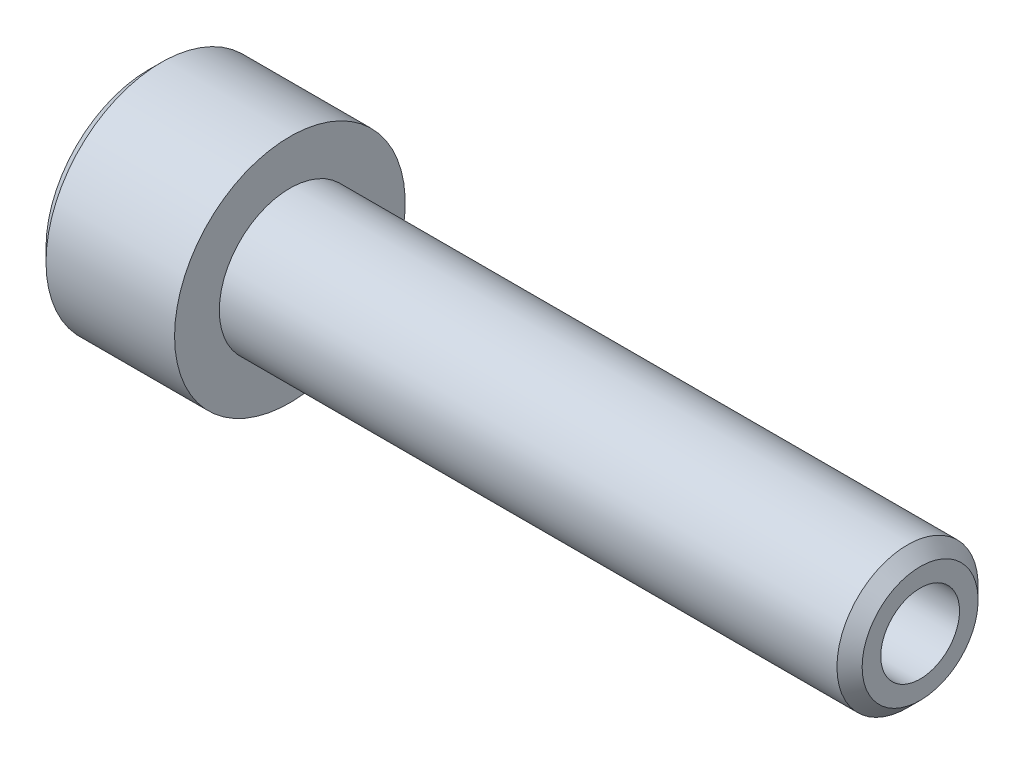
ISO-10303-21;
HEADER;
FILE_DESCRIPTION(('STEP AP214'),'2;1');
FILE_NAME('part.step','',(''),(''),'','','');
FILE_SCHEMA(('AUTOMOTIVE_DESIGN { 1 0 10303 214 1 1 1 1 }'));
ENDSEC;
DATA;
#1=APPLICATION_CONTEXT('core data for automotive mechanical design processes');
#2=APPLICATION_PROTOCOL_DEFINITION('international standard','automotive_design',2000,#1);
#3=PRODUCT_CONTEXT('',#1,'mechanical');
#4=PRODUCT('Part','Part','',(#3));
#5=PRODUCT_RELATED_PRODUCT_CATEGORY('part','',(#4));
#6=PRODUCT_DEFINITION_FORMATION('','',#4);
#7=PRODUCT_DEFINITION_CONTEXT('part definition',#1,'design');
#8=PRODUCT_DEFINITION('design','',#6,#7);
#9=PRODUCT_DEFINITION_SHAPE('','',#8);
#10=(LENGTH_UNIT() NAMED_UNIT(*) SI_UNIT(.MILLI.,.METRE.));
#11=(NAMED_UNIT(*) PLANE_ANGLE_UNIT() SI_UNIT($,.RADIAN.));
#12=(NAMED_UNIT(*) SI_UNIT($,.STERADIAN.) SOLID_ANGLE_UNIT());
#13=UNCERTAINTY_MEASURE_WITH_UNIT(LENGTH_MEASURE(1.E-05),#10,'distance_accuracy_value','');
#14=(GEOMETRIC_REPRESENTATION_CONTEXT(3) GLOBAL_UNCERTAINTY_ASSIGNED_CONTEXT((#13)) GLOBAL_UNIT_ASSIGNED_CONTEXT((#10,
#11,#12)) REPRESENTATION_CONTEXT('',''));
#15=CARTESIAN_POINT('',(0.,0.,0.));
#16=DIRECTION('',(0.,0.,1.));
#17=DIRECTION('',(1.,0.,0.));
#18=AXIS2_PLACEMENT_3D('',#15,#16,#17);
#19=CARTESIAN_POINT('',(0.,1.42239999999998,0.));
#20=DIRECTION('',(-1.,0.,0.));
#21=DIRECTION('',(0.,0.,1.));
#22=AXIS2_PLACEMENT_3D('',#19,#20,#21);
#23=PLANE('',#22);
#24=CARTESIAN_POINT('',(0.,0.,0.));
#25=DIRECTION('',(-1.,0.,0.));
#26=DIRECTION('',(0.,0.,1.));
#27=AXIS2_PLACEMENT_3D('',#24,#25,#26);
#28=CIRCLE('',#27,2.3241);
#29=CARTESIAN_POINT('',(0.,0.,2.32409999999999));
#30=VERTEX_POINT('',#29);
#31=EDGE_CURVE('E144',#30,#30,#28,.T.);
#32=ORIENTED_EDGE('',*,*,#31,.F.);
#33=EDGE_LOOP('',(#32));
#34=FACE_BOUND('',#33,.T.);
#35=CARTESIAN_POINT('',(0.,0.,0.));
#36=DIRECTION('',(-1.,0.,0.));
#37=DIRECTION('',(0.,0.,1.));
#38=AXIS2_PLACEMENT_3D('',#35,#36,#37);
#39=CIRCLE('',#38,1.42239999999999);
#40=CARTESIAN_POINT('',(0.,0.,1.42239999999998));
#41=VERTEX_POINT('',#40);
#42=EDGE_CURVE('E11',#41,#41,#39,.T.);
#43=ORIENTED_EDGE('',*,*,#42,.T.);
#44=EDGE_LOOP('',(#43));
#45=FACE_BOUND('',#44,.T.);
#46=ADVANCED_FACE('F40',(#34,#45),#23,.F.);
#47=CARTESIAN_POINT('',(-52.8448,0.,0.));
#48=DIRECTION('',(-1.,0.,0.));
#49=DIRECTION('',(0.,0.,1.));
#50=AXIS2_PLACEMENT_3D('',#47,#48,#49);
#51=CYLINDRICAL_SURFACE('',#50,1.4224);
#52=CARTESIAN_POINT('',(12.446,0.,0.));
#53=DIRECTION('',(-1.,0.,0.));
#54=DIRECTION('',(0.,0.,1.));
#55=AXIS2_PLACEMENT_3D('',#52,#53,#54);
#56=CIRCLE('',#55,1.4224);
#57=CARTESIAN_POINT('',(12.446,0.,1.42239999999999));
#58=VERTEX_POINT('',#57);
#59=EDGE_CURVE('E48',#58,#58,#56,.T.);
#60=ORIENTED_EDGE('',*,*,#59,.T.);
#61=EDGE_LOOP('',(#60));
#62=FACE_BOUND('',#61,.T.);
#63=ORIENTED_EDGE('',*,*,#42,.F.);
#64=EDGE_LOOP('',(#63));
#65=FACE_BOUND('',#64,.T.);
#66=ADVANCED_FACE('F164',(#62,#65),#51,.T.);
#67=CARTESIAN_POINT('',(12.446,0.,0.));
#68=DIRECTION('',(-1.,0.,0.));
#69=DIRECTION('',(0.,0.,1.));
#70=AXIS2_PLACEMENT_3D('',#67,#68,#69);
#71=CONICAL_SURFACE('',#70,1.4224,0.785398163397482);
#72=CARTESIAN_POINT('',(12.7,0.,0.));
#73=DIRECTION('',(-1.,0.,0.));
#74=DIRECTION('',(0.,0.,1.));
#75=AXIS2_PLACEMENT_3D('',#72,#73,#74);
#76=CIRCLE('',#75,1.16839999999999);
#77=CARTESIAN_POINT('',(12.7,0.,1.16839999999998));
#78=VERTEX_POINT('',#77);
#79=EDGE_CURVE('E158',#78,#78,#76,.T.);
#80=ORIENTED_EDGE('',*,*,#79,.T.);
#81=EDGE_LOOP('',(#80));
#82=FACE_BOUND('',#81,.T.);
#83=ORIENTED_EDGE('',*,*,#59,.F.);
#84=EDGE_LOOP('',(#83));
#85=FACE_BOUND('',#84,.T.);
#86=ADVANCED_FACE('F167',(#82,#85),#71,.T.);
#87=CARTESIAN_POINT('',(12.7,1.16839999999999,0.));
#88=DIRECTION('',(1.,0.,0.));
#89=DIRECTION('',(0.,0.,-1.));
#90=AXIS2_PLACEMENT_3D('',#87,#88,#89);
#91=PLANE('',#90);
#92=CARTESIAN_POINT('',(12.7,0.,0.));
#93=DIRECTION('',(1.,0.,0.));
#94=DIRECTION('',(0.,0.,-1.));
#95=AXIS2_PLACEMENT_3D('',#92,#93,#94);
#96=CIRCLE('',#95,0.793749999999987);
#97=CARTESIAN_POINT('',(12.7,0.,-0.793749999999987));
#98=VERTEX_POINT('',#97);
#99=EDGE_CURVE('E216',#98,#98,#96,.T.);
#100=ORIENTED_EDGE('',*,*,#99,.F.);
#101=EDGE_LOOP('',(#100));
#102=FACE_BOUND('',#101,.T.);
#103=ORIENTED_EDGE('',*,*,#79,.F.);
#104=EDGE_LOOP('',(#103));
#105=FACE_BOUND('',#104,.T.);
#106=ADVANCED_FACE('F169',(#102,#105),#91,.T.);
#107=CARTESIAN_POINT('',(-2.84479999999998,2.07009999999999,0.));
#108=DIRECTION('',(1.,0.,0.));
#109=DIRECTION('',(0.,0.,-1.));
#110=AXIS2_PLACEMENT_3D('',#107,#108,#109);
#111=PLANE('',#110);
#112=DIRECTION('',(0.,0.866025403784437,-0.500000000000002));
#113=VECTOR('',#112,1.);
#114=CARTESIAN_POINT('',(-2.84479999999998,-1.190625,-0.68740766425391));
#115=LINE('',#114,#113);
#116=CARTESIAN_POINT('',(-2.84479999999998,-1.190625,-0.68740766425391));
#117=VERTEX_POINT('',#116);
#118=CARTESIAN_POINT('',(-2.84479999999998,0.,-1.3748153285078));
#119=VERTEX_POINT('',#118);
#120=EDGE_CURVE('E130',#117,#119,#115,.T.);
#121=ORIENTED_EDGE('',*,*,#120,.T.);
#122=DIRECTION('',(0.,-0.866025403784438,-0.500000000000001));
#123=VECTOR('',#122,1.);
#124=CARTESIAN_POINT('',(-2.84479999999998,1.19062499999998,-0.687407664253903));
#125=LINE('',#124,#123);
#126=CARTESIAN_POINT('',(-2.84479999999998,1.19062499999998,-0.687407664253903));
#127=VERTEX_POINT('',#126);
#128=EDGE_CURVE('E55',#127,#119,#125,.T.);
#129=ORIENTED_EDGE('',*,*,#128,.F.);
#130=DIRECTION('',(0.,0.,1.));
#131=VECTOR('',#130,1.);
#132=CARTESIAN_POINT('',(-2.84479999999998,1.19062499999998,-0.687407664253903));
#133=LINE('',#132,#131);
#134=CARTESIAN_POINT('',(-2.84479999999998,1.190625,0.687407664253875));
#135=VERTEX_POINT('',#134);
#136=EDGE_CURVE('E139',#127,#135,#133,.T.);
#137=ORIENTED_EDGE('',*,*,#136,.T.);
#138=DIRECTION('',(0.,-0.866025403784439,0.499999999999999));
#139=VECTOR('',#138,1.);
#140=CARTESIAN_POINT('',(-2.84479999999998,1.190625,0.687407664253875));
#141=LINE('',#140,#139);
#142=CARTESIAN_POINT('',(-2.84479999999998,0.,1.37481532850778));
#143=VERTEX_POINT('',#142);
#144=EDGE_CURVE('E137',#135,#143,#141,.T.);
#145=ORIENTED_EDGE('',*,*,#144,.T.);
#146=DIRECTION('',(0.,0.866025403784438,0.500000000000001));
#147=VECTOR('',#146,1.);
#148=CARTESIAN_POINT('',(-2.84479999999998,-1.19062499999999,0.687407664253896));
#149=LINE('',#148,#147);
#150=CARTESIAN_POINT('',(-2.84479999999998,-1.19062499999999,0.687407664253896));
#151=VERTEX_POINT('',#150);
#152=EDGE_CURVE('E115',#151,#143,#149,.T.);
#153=ORIENTED_EDGE('',*,*,#152,.F.);
#154=DIRECTION('',(0.,0.,1.));
#155=VECTOR('',#154,1.);
#156=CARTESIAN_POINT('',(-2.84479999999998,-1.190625,-0.68740766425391));
#157=LINE('',#156,#155);
#158=EDGE_CURVE('E133',#117,#151,#157,.T.);
#159=ORIENTED_EDGE('',*,*,#158,.F.);
#160=EDGE_LOOP('',(#121,#129,#137,#145,#153,#159));
#161=FACE_BOUND('',#160,.T.);
#162=CARTESIAN_POINT('',(-2.84479999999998,0.,0.));
#163=DIRECTION('',(-1.,0.,0.));
#164=DIRECTION('',(0.,0.,1.));
#165=AXIS2_PLACEMENT_3D('',#162,#163,#164);
#166=CIRCLE('',#165,2.0701);
#167=CARTESIAN_POINT('',(-2.84479999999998,0.,2.07009999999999));
#168=VERTEX_POINT('',#167);
#169=EDGE_CURVE('E155',#168,#168,#166,.T.);
#170=ORIENTED_EDGE('',*,*,#169,.T.);
#171=EDGE_LOOP('',(#170));
#172=FACE_BOUND('',#171,.T.);
#173=ADVANCED_FACE('F176',(#161,#172),#111,.F.);
#174=CARTESIAN_POINT('',(-2.5908,0.,0.));
#175=DIRECTION('',(1.,0.,0.));
#176=DIRECTION('',(0.,0.,-1.));
#177=AXIS2_PLACEMENT_3D('',#174,#175,#176);
#178=CONICAL_SURFACE('',#177,2.3241,0.78539816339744);
#179=ORIENTED_EDGE('',*,*,#169,.F.);
#180=EDGE_LOOP('',(#179));
#181=FACE_BOUND('',#180,.T.);
#182=CARTESIAN_POINT('',(-2.5908,0.,0.));
#183=DIRECTION('',(-1.,0.,0.));
#184=DIRECTION('',(0.,0.,1.));
#185=AXIS2_PLACEMENT_3D('',#182,#183,#184);
#186=CIRCLE('',#185,2.3241);
#187=CARTESIAN_POINT('',(-2.5908,0.,2.32409999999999));
#188=VERTEX_POINT('',#187);
#189=EDGE_CURVE('E152',#188,#188,#186,.T.);
#190=ORIENTED_EDGE('',*,*,#189,.T.);
#191=EDGE_LOOP('',(#190));
#192=FACE_BOUND('',#191,.T.);
#193=ADVANCED_FACE('F190',(#181,#192),#178,.T.);
#194=CARTESIAN_POINT('',(-52.8448,0.,0.));
#195=DIRECTION('',(-1.,0.,0.));
#196=DIRECTION('',(0.,0.,1.));
#197=AXIS2_PLACEMENT_3D('',#194,#195,#196);
#198=CYLINDRICAL_SURFACE('',#197,2.3241);
#199=ORIENTED_EDGE('',*,*,#189,.F.);
#200=EDGE_LOOP('',(#199));
#201=FACE_BOUND('',#200,.T.);
#202=ORIENTED_EDGE('',*,*,#31,.T.);
#203=EDGE_LOOP('',(#202));
#204=FACE_BOUND('',#203,.T.);
#205=ADVANCED_FACE('F187',(#201,#204),#198,.T.);
#206=CARTESIAN_POINT('',(-1.05886249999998,1.19062499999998,-0.687407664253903));
#207=DIRECTION('',(0.,0.500000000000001,-0.866025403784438));
#208=DIRECTION('',(0.,0.866025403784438,0.500000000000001));
#209=AXIS2_PLACEMENT_3D('',#206,#207,#208);
#210=PLANE('',#209);
#211=ORIENTED_EDGE('',*,*,#128,.T.);
#212=DIRECTION('',(-1.,0.,0.));
#213=VECTOR('',#212,1.);
#214=CARTESIAN_POINT('',(-1.05886249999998,0.,-1.3748153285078));
#215=LINE('',#214,#213);
#216=CARTESIAN_POINT('',(-1.05886249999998,0.,-1.3748153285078));
#217=VERTEX_POINT('',#216);
#218=EDGE_CURVE('E128',#217,#119,#215,.T.);
#219=ORIENTED_EDGE('',*,*,#218,.F.);
#220=DIRECTION('',(0.,-0.866025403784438,-0.500000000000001));
#221=VECTOR('',#220,1.);
#222=CARTESIAN_POINT('',(-1.05886249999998,1.19062499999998,-0.687407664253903));
#223=LINE('',#222,#221);
#224=CARTESIAN_POINT('',(-1.05886249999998,1.19062499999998,-0.687407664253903));
#225=VERTEX_POINT('',#224);
#226=EDGE_CURVE('E142',#225,#217,#223,.T.);
#227=ORIENTED_EDGE('',*,*,#226,.F.);
#228=DIRECTION('',(-1.,0.,0.));
#229=VECTOR('',#228,1.);
#230=CARTESIAN_POINT('',(-1.05886249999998,1.19062499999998,-0.687407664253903));
#231=LINE('',#230,#229);
#232=EDGE_CURVE('E63',#225,#127,#231,.T.);
#233=ORIENTED_EDGE('',*,*,#232,.T.);
#234=EDGE_LOOP('',(#211,#219,#227,#233));
#235=FACE_BOUND('',#234,.T.);
#236=ADVANCED_FACE('F189',(#235),#210,.F.);
#237=CARTESIAN_POINT('',(-1.05886249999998,1.19062499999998,-0.687407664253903));
#238=DIRECTION('',(0.,-1.,0.));
#239=DIRECTION('',(0.,0.,-1.));
#240=AXIS2_PLACEMENT_3D('',#237,#238,#239);
#241=PLANE('',#240);
#242=ORIENTED_EDGE('',*,*,#136,.F.);
#243=ORIENTED_EDGE('',*,*,#232,.F.);
#244=DIRECTION('',(0.,0.,1.));
#245=VECTOR('',#244,1.);
#246=CARTESIAN_POINT('',(-1.05886249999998,1.19062499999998,-0.687407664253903));
#247=LINE('',#246,#245);
#248=CARTESIAN_POINT('',(-1.05886249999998,1.190625,0.687407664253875));
#249=VERTEX_POINT('',#248);
#250=EDGE_CURVE('E107',#225,#249,#247,.T.);
#251=ORIENTED_EDGE('',*,*,#250,.T.);
#252=DIRECTION('',(-1.,0.,0.));
#253=VECTOR('',#252,1.);
#254=CARTESIAN_POINT('',(-1.05886249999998,1.190625,0.687407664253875));
#255=LINE('',#254,#253);
#256=EDGE_CURVE('E104',#249,#135,#255,.T.);
#257=ORIENTED_EDGE('',*,*,#256,.T.);
#258=EDGE_LOOP('',(#242,#243,#251,#257));
#259=FACE_BOUND('',#258,.T.);
#260=ADVANCED_FACE('F197',(#259),#241,.T.);
#261=CARTESIAN_POINT('',(-1.05886249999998,1.190625,0.687407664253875));
#262=DIRECTION('',(0.,-0.5,-0.86602540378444));
#263=DIRECTION('',(0.,0.86602540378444,-0.5));
#264=AXIS2_PLACEMENT_3D('',#261,#262,#263);
#265=PLANE('',#264);
#266=ORIENTED_EDGE('',*,*,#144,.F.);
#267=ORIENTED_EDGE('',*,*,#256,.F.);
#268=DIRECTION('',(0.,-0.866025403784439,0.499999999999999));
#269=VECTOR('',#268,1.);
#270=CARTESIAN_POINT('',(-1.05886249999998,1.190625,0.687407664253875));
#271=LINE('',#270,#269);
#272=CARTESIAN_POINT('',(-1.05886249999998,0.,1.37481532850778));
#273=VERTEX_POINT('',#272);
#274=EDGE_CURVE('E98',#249,#273,#271,.T.);
#275=ORIENTED_EDGE('',*,*,#274,.T.);
#276=DIRECTION('',(-1.,0.,0.));
#277=VECTOR('',#276,1.);
#278=CARTESIAN_POINT('',(-1.05886249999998,0.,1.37481532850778));
#279=LINE('',#278,#277);
#280=EDGE_CURVE('E102',#273,#143,#279,.T.);
#281=ORIENTED_EDGE('',*,*,#280,.T.);
#282=EDGE_LOOP('',(#266,#267,#275,#281));
#283=FACE_BOUND('',#282,.T.);
#284=ADVANCED_FACE('F101',(#283),#265,.T.);
#285=CARTESIAN_POINT('',(-1.05886249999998,-1.19062499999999,0.687407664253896));
#286=DIRECTION('',(0.,-0.500000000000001,0.866025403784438));
#287=DIRECTION('',(0.,-0.866025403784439,-0.500000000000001));
#288=AXIS2_PLACEMENT_3D('',#285,#286,#287);
#289=PLANE('',#288);
#290=ORIENTED_EDGE('',*,*,#152,.T.);
#291=ORIENTED_EDGE('',*,*,#280,.F.);
#292=DIRECTION('',(0.,0.866025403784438,0.500000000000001));
#293=VECTOR('',#292,1.);
#294=CARTESIAN_POINT('',(-1.05886249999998,-1.19062499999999,0.687407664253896));
#295=LINE('',#294,#293);
#296=CARTESIAN_POINT('',(-1.05886249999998,-1.19062499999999,0.687407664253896));
#297=VERTEX_POINT('',#296);
#298=EDGE_CURVE('E108',#297,#273,#295,.T.);
#299=ORIENTED_EDGE('',*,*,#298,.F.);
#300=DIRECTION('',(-1.,0.,0.));
#301=VECTOR('',#300,1.);
#302=CARTESIAN_POINT('',(-1.05886249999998,-1.19062499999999,0.687407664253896));
#303=LINE('',#302,#301);
#304=EDGE_CURVE('E117',#297,#151,#303,.T.);
#305=ORIENTED_EDGE('',*,*,#304,.T.);
#306=EDGE_LOOP('',(#290,#291,#299,#305));
#307=FACE_BOUND('',#306,.T.);
#308=ADVANCED_FACE('F112',(#307),#289,.F.);
#309=CARTESIAN_POINT('',(-1.05886249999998,-1.190625,-0.68740766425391));
#310=DIRECTION('',(0.,-1.,0.));
#311=DIRECTION('',(0.,0.,-1.));
#312=AXIS2_PLACEMENT_3D('',#309,#310,#311);
#313=PLANE('',#312);
#314=ORIENTED_EDGE('',*,*,#158,.T.);
#315=ORIENTED_EDGE('',*,*,#304,.F.);
#316=DIRECTION('',(0.,0.,1.));
#317=VECTOR('',#316,1.);
#318=CARTESIAN_POINT('',(-1.05886249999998,-1.190625,-0.68740766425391));
#319=LINE('',#318,#317);
#320=CARTESIAN_POINT('',(-1.05886249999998,-1.190625,-0.68740766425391));
#321=VERTEX_POINT('',#320);
#322=EDGE_CURVE('E122',#321,#297,#319,.T.);
#323=ORIENTED_EDGE('',*,*,#322,.F.);
#324=DIRECTION('',(-1.,0.,0.));
#325=VECTOR('',#324,1.);
#326=CARTESIAN_POINT('',(-1.05886249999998,-1.190625,-0.68740766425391));
#327=LINE('',#326,#325);
#328=EDGE_CURVE('E147',#321,#117,#327,.T.);
#329=ORIENTED_EDGE('',*,*,#328,.T.);
#330=EDGE_LOOP('',(#314,#315,#323,#329));
#331=FACE_BOUND('',#330,.T.);
#332=ADVANCED_FACE('F238',(#331),#313,.F.);
#333=CARTESIAN_POINT('',(-1.05886249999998,-1.190625,-0.68740766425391));
#334=DIRECTION('',(0.,0.500000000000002,0.866025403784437));
#335=DIRECTION('',(0.,-0.866025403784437,0.500000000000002));
#336=AXIS2_PLACEMENT_3D('',#333,#334,#335);
#337=PLANE('',#336);
#338=ORIENTED_EDGE('',*,*,#120,.F.);
#339=ORIENTED_EDGE('',*,*,#328,.F.);
#340=DIRECTION('',(0.,0.866025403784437,-0.500000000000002));
#341=VECTOR('',#340,1.);
#342=CARTESIAN_POINT('',(-1.05886249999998,-1.190625,-0.68740766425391));
#343=LINE('',#342,#341);
#344=EDGE_CURVE('E89',#321,#217,#343,.T.);
#345=ORIENTED_EDGE('',*,*,#344,.T.);
#346=ORIENTED_EDGE('',*,*,#218,.T.);
#347=EDGE_LOOP('',(#338,#339,#345,#346));
#348=FACE_BOUND('',#347,.T.);
#349=ADVANCED_FACE('F213',(#348),#337,.T.);
#350=CARTESIAN_POINT('',(-1.05886249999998,0.,-1.3748153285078));
#351=DIRECTION('',(1.,0.,0.));
#352=DIRECTION('',(0.,0.,-1.));
#353=AXIS2_PLACEMENT_3D('',#350,#351,#352);
#354=PLANE('',#353);
#355=CARTESIAN_POINT('',(-1.05886249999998,0.,0.));
#356=DIRECTION('',(1.,0.,0.));
#357=DIRECTION('',(0.,0.,-1.));
#358=AXIS2_PLACEMENT_3D('',#355,#356,#357);
#359=CIRCLE('',#358,0.793749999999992);
#360=CARTESIAN_POINT('',(-1.05886249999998,0.,-0.793749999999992));
#361=VERTEX_POINT('',#360);
#362=EDGE_CURVE('E43',#361,#361,#359,.T.);
#363=ORIENTED_EDGE('',*,*,#362,.T.);
#364=EDGE_LOOP('',(#363));
#365=FACE_BOUND('',#364,.T.);
#366=ORIENTED_EDGE('',*,*,#226,.T.);
#367=ORIENTED_EDGE('',*,*,#344,.F.);
#368=ORIENTED_EDGE('',*,*,#322,.T.);
#369=ORIENTED_EDGE('',*,*,#298,.T.);
#370=ORIENTED_EDGE('',*,*,#274,.F.);
#371=ORIENTED_EDGE('',*,*,#250,.F.);
#372=EDGE_LOOP('',(#366,#367,#368,#369,#370,#371));
#373=FACE_BOUND('',#372,.T.);
#374=ADVANCED_FACE('F120',(#365,#373),#354,.F.);
#375=CARTESIAN_POINT('',(12.7,0.,0.));
#376=DIRECTION('',(1.,0.,0.));
#377=DIRECTION('',(0.,0.,-1.));
#378=AXIS2_PLACEMENT_3D('',#375,#376,#377);
#379=CYLINDRICAL_SURFACE('',#378,0.793749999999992);
#380=ORIENTED_EDGE('',*,*,#99,.T.);
#381=EDGE_LOOP('',(#380));
#382=FACE_BOUND('',#381,.T.);
#383=ORIENTED_EDGE('',*,*,#362,.F.);
#384=EDGE_LOOP('',(#383));
#385=FACE_BOUND('',#384,.T.);
#386=ADVANCED_FACE('F224',(#382,#385),#379,.F.);
#387=CLOSED_SHELL('',(#46,#66,#86,#106,#173,#193,#205,#236,#260,#284,#308,#332,#349,#374,#386));
#388=MANIFOLD_SOLID_BREP('B2',#387);
#389=ADVANCED_BREP_SHAPE_REPRESENTATION('',(#18,#388),#14);
#390=SHAPE_DEFINITION_REPRESENTATION(#9,#389);
ENDSEC;
END-ISO-10303-21;
